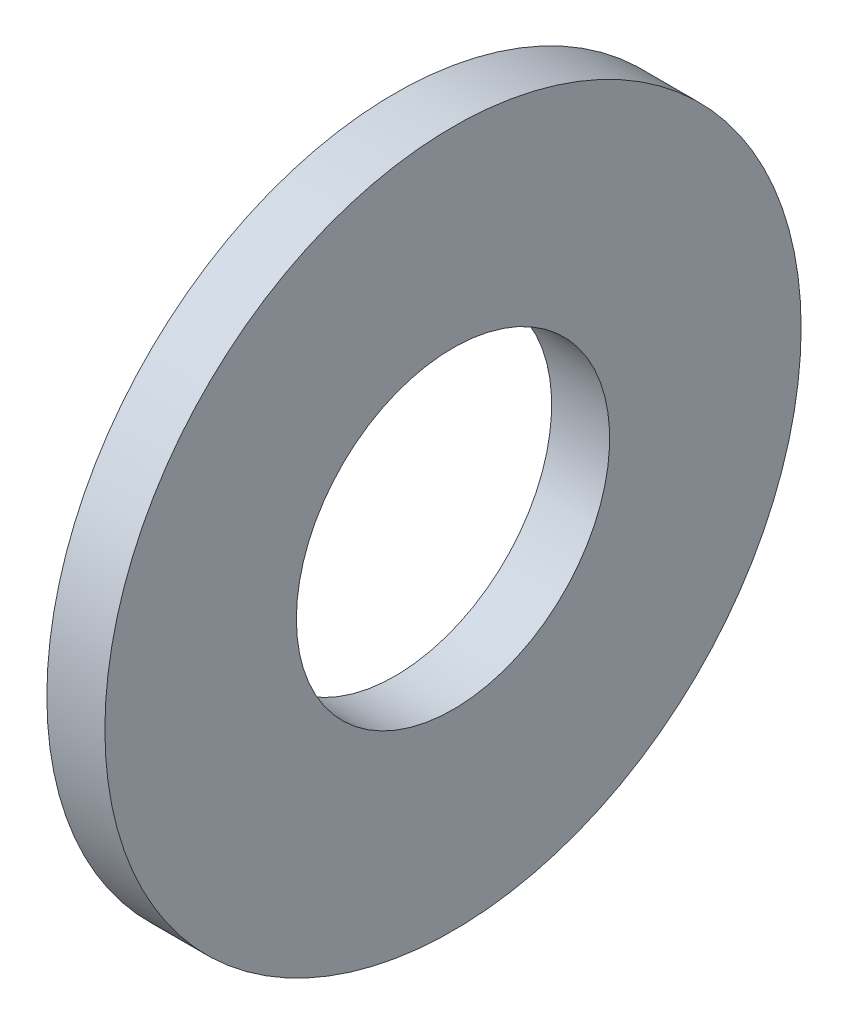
from build123d import *

# Parameters (mm, degrees)
SKETCH1_W = 0.5
SKETCH1_H = 1.65


with BuildPart() as part:
    # Sketch1 → Base-Revolve (revolve)
    with BuildSketch(Plane.XY, mode=Mode.PRIVATE) as base_revolve_sk:
        with Locations((-0.25, 2.175)):
            Rectangle(SKETCH1_W, SKETCH1_H)
    revolve(base_revolve_sk.sketch.rotate(Axis((-34.925, 0, 0), (1, 0, 0)), 90), axis=Axis((-34.925, 0, 0), (1, 0, 0)))


solid = part.part
